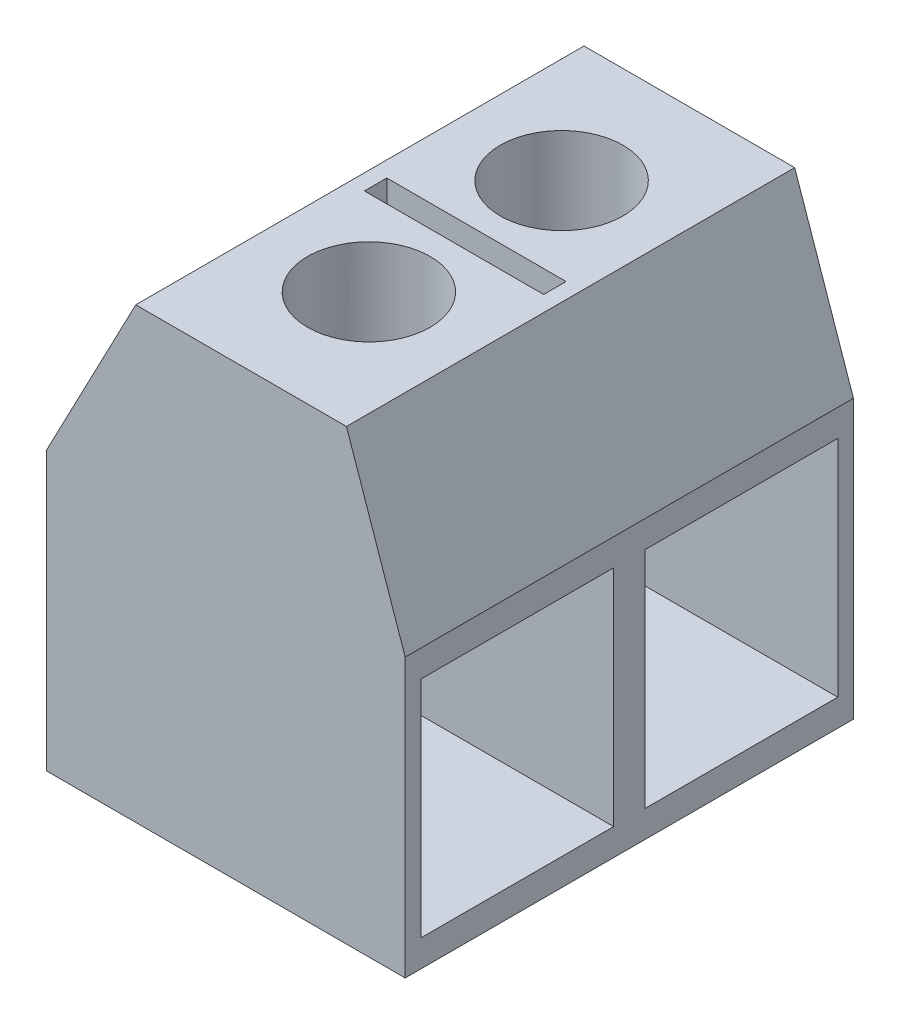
from build123d import *

# Parameters (mm, degrees)
BOSS_EXTRUDE1_DEPTH = 10
SKETCH2_W           = 4.3
SKETCH2_H           = 5
CUT_EXTRUDE1_DEPTH  = 5.3
SKETCH3_R           = 1.368686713
SKETCH3_W           = 4
SKETCH3_H           = 0.5
CUT_EXTRUDE2_DEPTH  = 5


with BuildPart() as part:
    # Sketch1 → Boss-Extrude1 (new body)
    with BuildSketch(Plane.XY):
        Polygon((-3.415220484, 0), (4.584779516, 0), (4.584779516, 6.2), (3.274734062, 10.00055008), (-1.425265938, 10.00055008), (-3.415220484, 6.2), align=None)
    extrude(amount=BOSS_EXTRUDE1_DEPTH)

    # Sketch2 → Cut-Extrude1 (cut)
    with BuildSketch(Plane(origin=(4.584779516, 0, 0), x_dir=(0, 0, -1), z_dir=(1, 0, 0))):
        with Locations((-7.5, 3.1)):
            Rectangle(SKETCH2_W, SKETCH2_H)
        with Locations((-2.5, 3.1)):
            Rectangle(SKETCH2_W, SKETCH2_H)
    extrude(amount=-CUT_EXTRUDE1_DEPTH, mode=Mode.SUBTRACT)

    # Sketch3 → Cut-Extrude2 (cut)
    with BuildSketch(Plane(origin=(0, 10.00055008, 0), x_dir=(1, 0, 0), z_dir=(0, 1, 0))):
        with Locations(Location((0.924734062, -2.85, 0), (0, 0, 180))):
            Circle(SKETCH3_R)
        with Locations(Location((0.924734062, -7.15, 0), (0, 0, 270))):
            Circle(SKETCH3_R)
        with Locations((0.924734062, -5)):
            Rectangle(SKETCH3_W, SKETCH3_H)
    extrude(amount=-CUT_EXTRUDE2_DEPTH, mode=Mode.SUBTRACT)


solid = part.part
